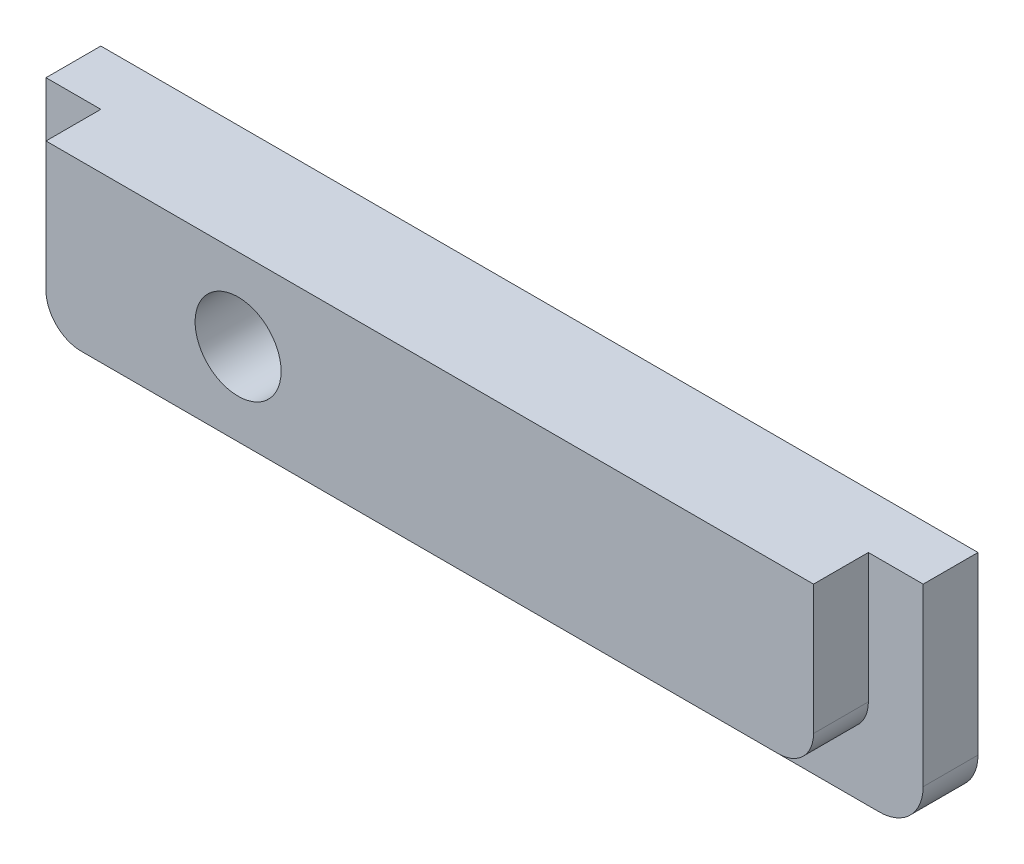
ISO-10303-21;
HEADER;
FILE_DESCRIPTION(('STEP AP214'),'2;1');
FILE_NAME('part.step','',(''),(''),'','','');
FILE_SCHEMA(('AUTOMOTIVE_DESIGN { 1 0 10303 214 1 1 1 1 }'));
ENDSEC;
DATA;
#1=APPLICATION_CONTEXT('core data for automotive mechanical design processes');
#2=APPLICATION_PROTOCOL_DEFINITION('international standard','automotive_design',2000,#1);
#3=PRODUCT_CONTEXT('',#1,'mechanical');
#4=PRODUCT('Part','Part','',(#3));
#5=PRODUCT_RELATED_PRODUCT_CATEGORY('part','',(#4));
#6=PRODUCT_DEFINITION_FORMATION('','',#4);
#7=PRODUCT_DEFINITION_CONTEXT('part definition',#1,'design');
#8=PRODUCT_DEFINITION('design','',#6,#7);
#9=PRODUCT_DEFINITION_SHAPE('','',#8);
#10=(LENGTH_UNIT() NAMED_UNIT(*) SI_UNIT(.MILLI.,.METRE.));
#11=(NAMED_UNIT(*) PLANE_ANGLE_UNIT() SI_UNIT($,.RADIAN.));
#12=(NAMED_UNIT(*) SI_UNIT($,.STERADIAN.) SOLID_ANGLE_UNIT());
#13=UNCERTAINTY_MEASURE_WITH_UNIT(LENGTH_MEASURE(1.E-05),#10,'distance_accuracy_value','');
#14=(GEOMETRIC_REPRESENTATION_CONTEXT(3) GLOBAL_UNCERTAINTY_ASSIGNED_CONTEXT((#13)) GLOBAL_UNIT_ASSIGNED_CONTEXT((#10,
#11,#12)) REPRESENTATION_CONTEXT('',''));
#15=CARTESIAN_POINT('',(0.,0.,0.));
#16=DIRECTION('',(0.,0.,1.));
#17=DIRECTION('',(1.,0.,0.));
#18=AXIS2_PLACEMENT_3D('',#15,#16,#17);
#19=CARTESIAN_POINT('',(44.45,9.525,3.175));
#20=DIRECTION('',(0.,-1.,0.));
#21=DIRECTION('',(1.,0.,0.));
#22=AXIS2_PLACEMENT_3D('',#19,#20,#21);
#23=PLANE('',#22);
#24=DIRECTION('',(0.,0.,-1.));
#25=VECTOR('',#24,1.);
#26=CARTESIAN_POINT('',(44.45,9.525,3.175));
#27=LINE('',#26,#25);
#28=CARTESIAN_POINT('',(44.45,9.525,3.175));
#29=VERTEX_POINT('',#28);
#30=CARTESIAN_POINT('',(44.45,9.525,0.));
#31=VERTEX_POINT('',#30);
#32=EDGE_CURVE('E264',#29,#31,#27,.T.);
#33=ORIENTED_EDGE('',*,*,#32,.T.);
#34=DIRECTION('',(-1.,0.,0.));
#35=VECTOR('',#34,1.);
#36=CARTESIAN_POINT('',(0.,9.525,0.));
#37=LINE('',#36,#35);
#38=CARTESIAN_POINT('',(47.625,9.525,0.));
#39=VERTEX_POINT('',#38);
#40=EDGE_CURVE('E139',#39,#31,#37,.T.);
#41=ORIENTED_EDGE('',*,*,#40,.F.);
#42=DIRECTION('',(0.,0.,1.));
#43=VECTOR('',#42,1.);
#44=CARTESIAN_POINT('',(47.625,9.525,-3.175));
#45=LINE('',#44,#43);
#46=CARTESIAN_POINT('',(47.625,9.525,-3.175));
#47=VERTEX_POINT('',#46);
#48=EDGE_CURVE('E127',#47,#39,#45,.T.);
#49=ORIENTED_EDGE('',*,*,#48,.F.);
#50=DIRECTION('',(-1.,0.,0.));
#51=VECTOR('',#50,1.);
#52=CARTESIAN_POINT('',(47.625,9.525,-3.175));
#53=LINE('',#52,#51);
#54=CARTESIAN_POINT('',(-3.175,9.525,-3.175));
#55=VERTEX_POINT('',#54);
#56=EDGE_CURVE('E130',#47,#55,#53,.T.);
#57=ORIENTED_EDGE('',*,*,#56,.T.);
#58=DIRECTION('',(0.,0.,1.));
#59=VECTOR('',#58,1.);
#60=CARTESIAN_POINT('',(-3.175,9.525,-3.175));
#61=LINE('',#60,#59);
#62=CARTESIAN_POINT('',(-3.175,9.525,0.));
#63=VERTEX_POINT('',#62);
#64=EDGE_CURVE('E140',#55,#63,#61,.T.);
#65=ORIENTED_EDGE('',*,*,#64,.T.);
#66=CARTESIAN_POINT('',(0.,9.525,0.));
#67=VERTEX_POINT('',#66);
#68=EDGE_CURVE('E156',#67,#63,#37,.T.);
#69=ORIENTED_EDGE('',*,*,#68,.F.);
#70=DIRECTION('',(0.,0.,-1.));
#71=VECTOR('',#70,1.);
#72=CARTESIAN_POINT('',(0.,9.525,3.175));
#73=LINE('',#72,#71);
#74=CARTESIAN_POINT('',(0.,9.525,3.175));
#75=VERTEX_POINT('',#74);
#76=EDGE_CURVE('E252',#75,#67,#73,.T.);
#77=ORIENTED_EDGE('',*,*,#76,.F.);
#78=DIRECTION('',(-1.,0.,0.));
#79=VECTOR('',#78,1.);
#80=CARTESIAN_POINT('',(44.45,9.525,3.175));
#81=LINE('',#80,#79);
#82=EDGE_CURVE('E266',#29,#75,#81,.T.);
#83=ORIENTED_EDGE('',*,*,#82,.F.);
#84=EDGE_LOOP('',(#33,#41,#49,#57,#65,#69,#77,#83));
#85=FACE_BOUND('',#84,.T.);
#86=ADVANCED_FACE('F33',(#85),#23,.F.);
#87=CARTESIAN_POINT('',(0.,9.525,3.175));
#88=DIRECTION('',(1.,0.,0.));
#89=DIRECTION('',(0.,1.,0.));
#90=AXIS2_PLACEMENT_3D('',#87,#88,#89);
#91=PLANE('',#90);
#92=DIRECTION('',(0.,-1.,0.));
#93=VECTOR('',#92,1.);
#94=CARTESIAN_POINT('',(0.,9.525,0.));
#95=LINE('',#94,#93);
#96=CARTESIAN_POINT('',(0.,2.032,0.));
#97=VERTEX_POINT('',#96);
#98=EDGE_CURVE('E170',#67,#97,#95,.T.);
#99=ORIENTED_EDGE('',*,*,#98,.T.);
#100=DIRECTION('',(0.,0.,-1.));
#101=VECTOR('',#100,1.);
#102=CARTESIAN_POINT('',(0.,2.032,3.175));
#103=LINE('',#102,#101);
#104=CARTESIAN_POINT('',(0.,2.032,3.175));
#105=VERTEX_POINT('',#104);
#106=EDGE_CURVE('E235',#97,#105,#103,.F.);
#107=ORIENTED_EDGE('',*,*,#106,.T.);
#108=DIRECTION('',(0.,-1.,0.));
#109=VECTOR('',#108,1.);
#110=CARTESIAN_POINT('',(0.,9.525,3.175));
#111=LINE('',#110,#109);
#112=EDGE_CURVE('E260',#75,#105,#111,.T.);
#113=ORIENTED_EDGE('',*,*,#112,.F.);
#114=ORIENTED_EDGE('',*,*,#76,.T.);
#115=EDGE_LOOP('',(#99,#107,#113,#114));
#116=FACE_BOUND('',#115,.T.);
#117=ADVANCED_FACE('F208',(#116),#91,.F.);
#118=CARTESIAN_POINT('',(0.,0.,3.175));
#119=DIRECTION('',(0.,1.,0.));
#120=DIRECTION('',(0.,0.,1.));
#121=AXIS2_PLACEMENT_3D('',#118,#119,#120);
#122=PLANE('',#121);
#123=DIRECTION('',(1.,0.,0.));
#124=VECTOR('',#123,1.);
#125=CARTESIAN_POINT('',(0.,0.,0.));
#126=LINE('',#125,#124);
#127=CARTESIAN_POINT('',(2.032,0.,0.));
#128=VERTEX_POINT('',#127);
#129=CARTESIAN_POINT('',(42.418,0.,0.));
#130=VERTEX_POINT('',#129);
#131=EDGE_CURVE('E247',#128,#130,#126,.T.);
#132=ORIENTED_EDGE('',*,*,#131,.T.);
#133=DIRECTION('',(0.,0.,-1.));
#134=VECTOR('',#133,1.);
#135=CARTESIAN_POINT('',(42.418,0.,3.175));
#136=LINE('',#135,#134);
#137=CARTESIAN_POINT('',(42.418,0.,3.175));
#138=VERTEX_POINT('',#137);
#139=EDGE_CURVE('E229',#130,#138,#136,.F.);
#140=ORIENTED_EDGE('',*,*,#139,.T.);
#141=DIRECTION('',(1.,0.,0.));
#142=VECTOR('',#141,1.);
#143=CARTESIAN_POINT('',(0.,0.,3.175));
#144=LINE('',#143,#142);
#145=CARTESIAN_POINT('',(2.032,0.,3.175));
#146=VERTEX_POINT('',#145);
#147=EDGE_CURVE('E258',#146,#138,#144,.T.);
#148=ORIENTED_EDGE('',*,*,#147,.F.);
#149=DIRECTION('',(0.,0.,-1.));
#150=VECTOR('',#149,1.);
#151=CARTESIAN_POINT('',(2.032,0.,3.175));
#152=LINE('',#151,#150);
#153=EDGE_CURVE('E255',#146,#128,#152,.T.);
#154=ORIENTED_EDGE('',*,*,#153,.T.);
#155=EDGE_LOOP('',(#132,#140,#148,#154));
#156=FACE_BOUND('',#155,.T.);
#157=ADVANCED_FACE('F213',(#156),#122,.F.);
#158=CARTESIAN_POINT('',(44.45,0.,3.175));
#159=DIRECTION('',(-1.,0.,0.));
#160=DIRECTION('',(0.,0.,1.));
#161=AXIS2_PLACEMENT_3D('',#158,#159,#160);
#162=PLANE('',#161);
#163=DIRECTION('',(0.,1.,0.));
#164=VECTOR('',#163,1.);
#165=CARTESIAN_POINT('',(44.45,0.,3.175));
#166=LINE('',#165,#164);
#167=CARTESIAN_POINT('',(44.45,2.032,3.175));
#168=VERTEX_POINT('',#167);
#169=EDGE_CURVE('E262',#168,#29,#166,.T.);
#170=ORIENTED_EDGE('',*,*,#169,.F.);
#171=DIRECTION('',(0.,0.,-1.));
#172=VECTOR('',#171,1.);
#173=CARTESIAN_POINT('',(44.45,2.032,3.175));
#174=LINE('',#173,#172);
#175=CARTESIAN_POINT('',(44.45,2.032,0.));
#176=VERTEX_POINT('',#175);
#177=EDGE_CURVE('E231',#168,#176,#174,.T.);
#178=ORIENTED_EDGE('',*,*,#177,.T.);
#179=DIRECTION('',(0.,1.,0.));
#180=VECTOR('',#179,1.);
#181=CARTESIAN_POINT('',(44.45,0.,0.));
#182=LINE('',#181,#180);
#183=EDGE_CURVE('E270',#176,#31,#182,.T.);
#184=ORIENTED_EDGE('',*,*,#183,.T.);
#185=ORIENTED_EDGE('',*,*,#32,.F.);
#186=EDGE_LOOP('',(#170,#178,#184,#185));
#187=FACE_BOUND('',#186,.T.);
#188=ADVANCED_FACE('F286',(#187),#162,.F.);
#189=CARTESIAN_POINT('',(0.,0.,3.175));
#190=DIRECTION('',(0.,0.,1.));
#191=DIRECTION('',(1.,0.,0.));
#192=AXIS2_PLACEMENT_3D('',#189,#190,#191);
#193=PLANE('',#192);
#194=CARTESIAN_POINT('',(11.1252,4.7752,3.175));
#195=DIRECTION('',(0.,0.,1.));
#196=DIRECTION('',(1.,0.,0.));
#197=AXIS2_PLACEMENT_3D('',#194,#195,#196);
#198=CIRCLE('',#197,2.4892);
#199=CARTESIAN_POINT('',(13.6144,4.7752,3.175));
#200=VERTEX_POINT('',#199);
#201=EDGE_CURVE('E151',#200,#200,#198,.T.);
#202=ORIENTED_EDGE('',*,*,#201,.F.);
#203=EDGE_LOOP('',(#202));
#204=FACE_BOUND('',#203,.T.);
#205=ORIENTED_EDGE('',*,*,#147,.T.);
#206=CARTESIAN_POINT('',(42.418,2.032,3.175));
#207=DIRECTION('',(0.,0.,1.));
#208=DIRECTION('',(1.,0.,0.));
#209=AXIS2_PLACEMENT_3D('',#206,#207,#208);
#210=CIRCLE('',#209,2.032);
#211=EDGE_CURVE('E228',#138,#168,#210,.T.);
#212=ORIENTED_EDGE('',*,*,#211,.T.);
#213=ORIENTED_EDGE('',*,*,#169,.T.);
#214=ORIENTED_EDGE('',*,*,#82,.T.);
#215=ORIENTED_EDGE('',*,*,#112,.T.);
#216=CARTESIAN_POINT('',(2.032,2.032,3.175));
#217=DIRECTION('',(0.,0.,1.));
#218=DIRECTION('',(1.,0.,0.));
#219=AXIS2_PLACEMENT_3D('',#216,#217,#218);
#220=CIRCLE('',#219,2.032);
#221=EDGE_CURVE('E236',#105,#146,#220,.T.);
#222=ORIENTED_EDGE('',*,*,#221,.T.);
#223=EDGE_LOOP('',(#205,#212,#213,#214,#215,#222));
#224=FACE_BOUND('',#223,.T.);
#225=ADVANCED_FACE('F257',(#204,#224),#193,.T.);
#226=CARTESIAN_POINT('',(0.,0.,0.));
#227=DIRECTION('',(0.,0.,1.));
#228=DIRECTION('',(1.,0.,0.));
#229=AXIS2_PLACEMENT_3D('',#226,#227,#228);
#230=PLANE('',#229);
#231=DIRECTION('',(1.,0.,0.));
#232=VECTOR('',#231,1.);
#233=CARTESIAN_POINT('',(-3.175,-3.175,0.));
#234=LINE('',#233,#232);
#235=CARTESIAN_POINT('',(-0.634999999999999,-3.175,0.));
#236=VERTEX_POINT('',#235);
#237=CARTESIAN_POINT('',(45.085,-3.175,0.));
#238=VERTEX_POINT('',#237);
#239=EDGE_CURVE('E150',#236,#238,#234,.T.);
#240=ORIENTED_EDGE('',*,*,#239,.T.);
#241=CARTESIAN_POINT('',(45.085,-0.635,0.));
#242=DIRECTION('',(0.,0.,1.));
#243=DIRECTION('',(1.,0.,0.));
#244=AXIS2_PLACEMENT_3D('',#241,#242,#243);
#245=CIRCLE('',#244,2.54);
#246=CARTESIAN_POINT('',(47.625,-0.635,0.));
#247=VERTEX_POINT('',#246);
#248=EDGE_CURVE('E181',#238,#247,#245,.T.);
#249=ORIENTED_EDGE('',*,*,#248,.T.);
#250=DIRECTION('',(0.,1.,0.));
#251=VECTOR('',#250,1.);
#252=CARTESIAN_POINT('',(47.625,-3.175,0.));
#253=LINE('',#252,#251);
#254=EDGE_CURVE('E154',#247,#39,#253,.T.);
#255=ORIENTED_EDGE('',*,*,#254,.T.);
#256=ORIENTED_EDGE('',*,*,#40,.T.);
#257=ORIENTED_EDGE('',*,*,#183,.F.);
#258=CARTESIAN_POINT('',(42.418,2.032,0.));
#259=DIRECTION('',(0.,0.,1.));
#260=DIRECTION('',(1.,0.,0.));
#261=AXIS2_PLACEMENT_3D('',#258,#259,#260);
#262=CIRCLE('',#261,2.032);
#263=EDGE_CURVE('E238',#176,#130,#262,.F.);
#264=ORIENTED_EDGE('',*,*,#263,.T.);
#265=ORIENTED_EDGE('',*,*,#131,.F.);
#266=CARTESIAN_POINT('',(2.032,2.032,0.));
#267=DIRECTION('',(0.,0.,1.));
#268=DIRECTION('',(1.,0.,0.));
#269=AXIS2_PLACEMENT_3D('',#266,#267,#268);
#270=CIRCLE('',#269,2.032);
#271=EDGE_CURVE('E244',#128,#97,#270,.F.);
#272=ORIENTED_EDGE('',*,*,#271,.T.);
#273=ORIENTED_EDGE('',*,*,#98,.F.);
#274=ORIENTED_EDGE('',*,*,#68,.T.);
#275=DIRECTION('',(0.,-1.,0.));
#276=VECTOR('',#275,1.);
#277=CARTESIAN_POINT('',(-3.175,9.525,0.));
#278=LINE('',#277,#276);
#279=CARTESIAN_POINT('',(-3.175,-0.635,0.));
#280=VERTEX_POINT('',#279);
#281=EDGE_CURVE('E147',#63,#280,#278,.T.);
#282=ORIENTED_EDGE('',*,*,#281,.T.);
#283=CARTESIAN_POINT('',(-0.634999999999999,-0.635,0.));
#284=DIRECTION('',(0.,0.,1.));
#285=DIRECTION('',(1.,0.,0.));
#286=AXIS2_PLACEMENT_3D('',#283,#284,#285);
#287=CIRCLE('',#286,2.54);
#288=EDGE_CURVE('E178',#280,#236,#287,.T.);
#289=ORIENTED_EDGE('',*,*,#288,.T.);
#290=EDGE_LOOP('',(#240,#249,#255,#256,#257,#264,#265,#272,#273,#274,#282,#289));
#291=FACE_BOUND('',#290,.T.);
#292=ADVANCED_FACE('F167',(#291),#230,.T.);
#293=CARTESIAN_POINT('',(-3.175,9.525,-3.175));
#294=DIRECTION('',(-1.,0.,0.));
#295=DIRECTION('',(0.,-1.,0.));
#296=AXIS2_PLACEMENT_3D('',#293,#294,#295);
#297=PLANE('',#296);
#298=DIRECTION('',(0.,-1.,0.));
#299=VECTOR('',#298,1.);
#300=CARTESIAN_POINT('',(-3.175,9.525,-3.175));
#301=LINE('',#300,#299);
#302=CARTESIAN_POINT('',(-3.175,-0.635,-3.175));
#303=VERTEX_POINT('',#302);
#304=EDGE_CURVE('E143',#55,#303,#301,.T.);
#305=ORIENTED_EDGE('',*,*,#304,.T.);
#306=DIRECTION('',(0.,0.,1.));
#307=VECTOR('',#306,1.);
#308=CARTESIAN_POINT('',(-3.175,-0.635,-3.175));
#309=LINE('',#308,#307);
#310=EDGE_CURVE('E11',#303,#280,#309,.T.);
#311=ORIENTED_EDGE('',*,*,#310,.T.);
#312=ORIENTED_EDGE('',*,*,#281,.F.);
#313=ORIENTED_EDGE('',*,*,#64,.F.);
#314=EDGE_LOOP('',(#305,#311,#312,#313));
#315=FACE_BOUND('',#314,.T.);
#316=ADVANCED_FACE('F174',(#315),#297,.T.);
#317=CARTESIAN_POINT('',(47.625,-3.175,-3.175));
#318=DIRECTION('',(1.,0.,0.));
#319=DIRECTION('',(0.,0.,-1.));
#320=AXIS2_PLACEMENT_3D('',#317,#318,#319);
#321=PLANE('',#320);
#322=ORIENTED_EDGE('',*,*,#254,.F.);
#323=DIRECTION('',(0.,0.,1.));
#324=VECTOR('',#323,1.);
#325=CARTESIAN_POINT('',(47.625,-0.635,-3.175));
#326=LINE('',#325,#324);
#327=CARTESIAN_POINT('',(47.625,-0.635,-3.175));
#328=VERTEX_POINT('',#327);
#329=EDGE_CURVE('E57',#247,#328,#326,.F.);
#330=ORIENTED_EDGE('',*,*,#329,.T.);
#331=DIRECTION('',(0.,1.,0.));
#332=VECTOR('',#331,1.);
#333=CARTESIAN_POINT('',(47.625,-3.175,-3.175));
#334=LINE('',#333,#332);
#335=EDGE_CURVE('E124',#328,#47,#334,.T.);
#336=ORIENTED_EDGE('',*,*,#335,.T.);
#337=ORIENTED_EDGE('',*,*,#48,.T.);
#338=EDGE_LOOP('',(#322,#330,#336,#337));
#339=FACE_BOUND('',#338,.T.);
#340=ADVANCED_FACE('F126',(#339),#321,.T.);
#341=CARTESIAN_POINT('',(-3.175,-3.175,-3.175));
#342=DIRECTION('',(0.,-1.,0.));
#343=DIRECTION('',(0.,0.,-1.));
#344=AXIS2_PLACEMENT_3D('',#341,#342,#343);
#345=PLANE('',#344);
#346=DIRECTION('',(1.,0.,0.));
#347=VECTOR('',#346,1.);
#348=CARTESIAN_POINT('',(-3.175,-3.175,-3.175));
#349=LINE('',#348,#347);
#350=CARTESIAN_POINT('',(-0.634999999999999,-3.175,-3.175));
#351=VERTEX_POINT('',#350);
#352=CARTESIAN_POINT('',(45.085,-3.175,-3.175));
#353=VERTEX_POINT('',#352);
#354=EDGE_CURVE('E131',#351,#353,#349,.T.);
#355=ORIENTED_EDGE('',*,*,#354,.T.);
#356=DIRECTION('',(0.,0.,1.));
#357=VECTOR('',#356,1.);
#358=CARTESIAN_POINT('',(45.085,-3.175,-3.175));
#359=LINE('',#358,#357);
#360=EDGE_CURVE('E182',#353,#238,#359,.T.);
#361=ORIENTED_EDGE('',*,*,#360,.T.);
#362=ORIENTED_EDGE('',*,*,#239,.F.);
#363=DIRECTION('',(0.,0.,1.));
#364=VECTOR('',#363,1.);
#365=CARTESIAN_POINT('',(-0.634999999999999,-3.175,-3.175));
#366=LINE('',#365,#364);
#367=EDGE_CURVE('E179',#236,#351,#366,.F.);
#368=ORIENTED_EDGE('',*,*,#367,.T.);
#369=EDGE_LOOP('',(#355,#361,#362,#368));
#370=FACE_BOUND('',#369,.T.);
#371=ADVANCED_FACE('F195',(#370),#345,.T.);
#372=CARTESIAN_POINT('',(0.,0.,-3.175));
#373=DIRECTION('',(0.,0.,1.));
#374=DIRECTION('',(1.,0.,0.));
#375=AXIS2_PLACEMENT_3D('',#372,#373,#374);
#376=PLANE('',#375);
#377=CARTESIAN_POINT('',(11.1252,4.7752,-3.175));
#378=DIRECTION('',(0.,0.,1.));
#379=DIRECTION('',(1.,0.,0.));
#380=AXIS2_PLACEMENT_3D('',#377,#378,#379);
#381=CIRCLE('',#380,2.4892);
#382=CARTESIAN_POINT('',(13.6144,4.7752,-3.175));
#383=VERTEX_POINT('',#382);
#384=EDGE_CURVE('E37',#383,#383,#381,.T.);
#385=ORIENTED_EDGE('',*,*,#384,.T.);
#386=EDGE_LOOP('',(#385));
#387=FACE_BOUND('',#386,.T.);
#388=ORIENTED_EDGE('',*,*,#335,.F.);
#389=CARTESIAN_POINT('',(45.085,-0.635,-3.175));
#390=DIRECTION('',(0.,0.,1.));
#391=DIRECTION('',(1.,0.,0.));
#392=AXIS2_PLACEMENT_3D('',#389,#390,#391);
#393=CIRCLE('',#392,2.54);
#394=EDGE_CURVE('E42',#328,#353,#393,.F.);
#395=ORIENTED_EDGE('',*,*,#394,.T.);
#396=ORIENTED_EDGE('',*,*,#354,.F.);
#397=CARTESIAN_POINT('',(-0.634999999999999,-0.635,-3.175));
#398=DIRECTION('',(0.,0.,1.));
#399=DIRECTION('',(1.,0.,0.));
#400=AXIS2_PLACEMENT_3D('',#397,#398,#399);
#401=CIRCLE('',#400,2.54);
#402=EDGE_CURVE('E49',#351,#303,#401,.F.);
#403=ORIENTED_EDGE('',*,*,#402,.T.);
#404=ORIENTED_EDGE('',*,*,#304,.F.);
#405=ORIENTED_EDGE('',*,*,#56,.F.);
#406=EDGE_LOOP('',(#388,#395,#396,#403,#404,#405));
#407=FACE_BOUND('',#406,.T.);
#408=ADVANCED_FACE('F142',(#387,#407),#376,.F.);
#409=CARTESIAN_POINT('',(42.418,2.032,3.175));
#410=DIRECTION('',(0.,0.,-1.));
#411=DIRECTION('',(-1.,0.,0.));
#412=AXIS2_PLACEMENT_3D('',#409,#410,#411);
#413=CYLINDRICAL_SURFACE('',#412,2.032);
#414=ORIENTED_EDGE('',*,*,#211,.F.);
#415=ORIENTED_EDGE('',*,*,#139,.F.);
#416=ORIENTED_EDGE('',*,*,#263,.F.);
#417=ORIENTED_EDGE('',*,*,#177,.F.);
#418=EDGE_LOOP('',(#414,#415,#416,#417));
#419=FACE_BOUND('',#418,.T.);
#420=ADVANCED_FACE('F204',(#419),#413,.T.);
#421=CARTESIAN_POINT('',(2.032,2.032,3.175));
#422=DIRECTION('',(0.,0.,-1.));
#423=DIRECTION('',(-1.,0.,0.));
#424=AXIS2_PLACEMENT_3D('',#421,#422,#423);
#425=CYLINDRICAL_SURFACE('',#424,2.032);
#426=ORIENTED_EDGE('',*,*,#221,.F.);
#427=ORIENTED_EDGE('',*,*,#106,.F.);
#428=ORIENTED_EDGE('',*,*,#271,.F.);
#429=ORIENTED_EDGE('',*,*,#153,.F.);
#430=EDGE_LOOP('',(#426,#427,#428,#429));
#431=FACE_BOUND('',#430,.T.);
#432=ADVANCED_FACE('F198',(#431),#425,.T.);
#433=CARTESIAN_POINT('',(45.085,-0.635,-3.175));
#434=DIRECTION('',(0.,0.,1.));
#435=DIRECTION('',(1.,0.,0.));
#436=AXIS2_PLACEMENT_3D('',#433,#434,#435);
#437=CYLINDRICAL_SURFACE('',#436,2.54);
#438=ORIENTED_EDGE('',*,*,#394,.F.);
#439=ORIENTED_EDGE('',*,*,#329,.F.);
#440=ORIENTED_EDGE('',*,*,#248,.F.);
#441=ORIENTED_EDGE('',*,*,#360,.F.);
#442=EDGE_LOOP('',(#438,#439,#440,#441));
#443=FACE_BOUND('',#442,.T.);
#444=ADVANCED_FACE('F196',(#443),#437,.T.);
#445=CARTESIAN_POINT('',(-0.634999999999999,-0.635,-3.175));
#446=DIRECTION('',(0.,0.,1.));
#447=DIRECTION('',(1.,0.,0.));
#448=AXIS2_PLACEMENT_3D('',#445,#446,#447);
#449=CYLINDRICAL_SURFACE('',#448,2.54);
#450=ORIENTED_EDGE('',*,*,#402,.F.);
#451=ORIENTED_EDGE('',*,*,#367,.F.);
#452=ORIENTED_EDGE('',*,*,#288,.F.);
#453=ORIENTED_EDGE('',*,*,#310,.F.);
#454=EDGE_LOOP('',(#450,#451,#452,#453));
#455=FACE_BOUND('',#454,.T.);
#456=ADVANCED_FACE('F35',(#455),#449,.T.);
#457=CARTESIAN_POINT('',(11.1252,4.7752,-12.7));
#458=DIRECTION('',(0.,0.,1.));
#459=DIRECTION('',(1.,0.,0.));
#460=AXIS2_PLACEMENT_3D('',#457,#458,#459);
#461=CYLINDRICAL_SURFACE('',#460,2.4892);
#462=ORIENTED_EDGE('',*,*,#201,.T.);
#463=EDGE_LOOP('',(#462));
#464=FACE_BOUND('',#463,.T.);
#465=ORIENTED_EDGE('',*,*,#384,.F.);
#466=EDGE_LOOP('',(#465));
#467=FACE_BOUND('',#466,.T.);
#468=ADVANCED_FACE('F203',(#464,#467),#461,.F.);
#469=CLOSED_SHELL('',(#86,#117,#157,#188,#225,#292,#316,#340,#371,#408,#420,#432,#444,#456,#468));
#470=MANIFOLD_SOLID_BREP('B2',#469);
#471=ADVANCED_BREP_SHAPE_REPRESENTATION('',(#18,#470),#14);
#472=SHAPE_DEFINITION_REPRESENTATION(#9,#471);
ENDSEC;
END-ISO-10303-21;
